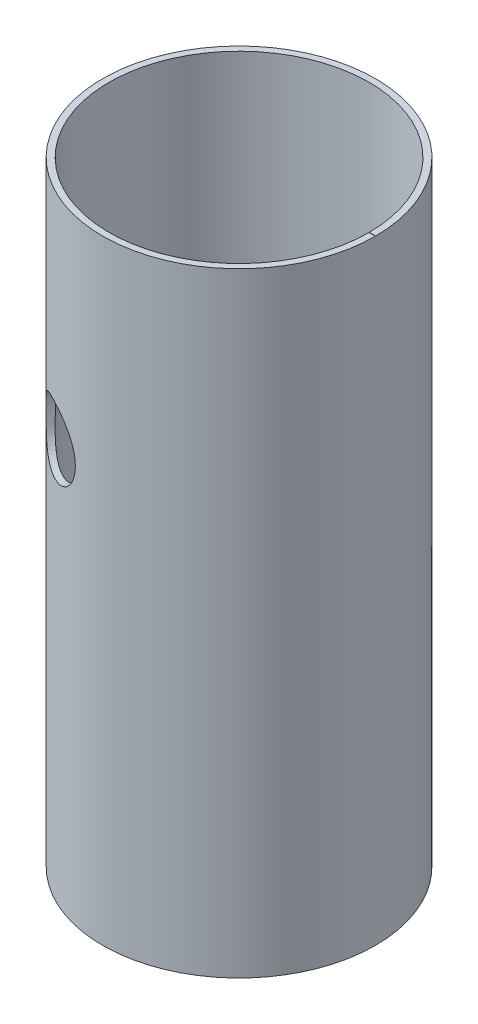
ISO-10303-21;
HEADER;
FILE_DESCRIPTION(('STEP AP214'),'2;1');
FILE_NAME('part.step','',(''),(''),'','','');
FILE_SCHEMA(('AUTOMOTIVE_DESIGN { 1 0 10303 214 1 1 1 1 }'));
ENDSEC;
DATA;
#1=APPLICATION_CONTEXT('core data for automotive mechanical design processes');
#2=APPLICATION_PROTOCOL_DEFINITION('international standard','automotive_design',2000,#1);
#3=PRODUCT_CONTEXT('',#1,'mechanical');
#4=PRODUCT('Part','Part','',(#3));
#5=PRODUCT_RELATED_PRODUCT_CATEGORY('part','',(#4));
#6=PRODUCT_DEFINITION_FORMATION('','',#4);
#7=PRODUCT_DEFINITION_CONTEXT('part definition',#1,'design');
#8=PRODUCT_DEFINITION('design','',#6,#7);
#9=PRODUCT_DEFINITION_SHAPE('','',#8);
#10=(LENGTH_UNIT() NAMED_UNIT(*) SI_UNIT(.MILLI.,.METRE.));
#11=(NAMED_UNIT(*) PLANE_ANGLE_UNIT() SI_UNIT($,.RADIAN.));
#12=(NAMED_UNIT(*) SI_UNIT($,.STERADIAN.) SOLID_ANGLE_UNIT());
#13=UNCERTAINTY_MEASURE_WITH_UNIT(LENGTH_MEASURE(1.E-05),#10,'distance_accuracy_value','');
#14=(GEOMETRIC_REPRESENTATION_CONTEXT(3) GLOBAL_UNCERTAINTY_ASSIGNED_CONTEXT((#13)) GLOBAL_UNIT_ASSIGNED_CONTEXT((#10,
#11,#12)) REPRESENTATION_CONTEXT('',''));
#15=CARTESIAN_POINT('',(0.,0.,0.));
#16=DIRECTION('',(0.,0.,1.));
#17=DIRECTION('',(1.,0.,0.));
#18=AXIS2_PLACEMENT_3D('',#15,#16,#17);
#19=CARTESIAN_POINT('',(100.573445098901,340.5,-330.875513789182));
#20=DIRECTION('',(0.,-1.,0.));
#21=DIRECTION('',(0.,0.,-1.));
#22=AXIS2_PLACEMENT_3D('',#19,#20,#21);
#23=CYLINDRICAL_SURFACE('',#22,214.617906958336);
#24=CARTESIAN_POINT('',(52.,0.,-121.826556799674));
#25=CARTESIAN_POINT('',(51.9999994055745,-1.4245583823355,-121.826556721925));
#26=CARTESIAN_POINT('',(51.9414198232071,-2.84912739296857,-121.840142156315));
#27=CARTESIAN_POINT('',(51.7075798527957,-5.68813599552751,-121.894683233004));
#28=CARTESIAN_POINT('',(51.532318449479,-7.1025754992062,-121.93563911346));
#29=CARTESIAN_POINT('',(51.0665503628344,-9.91130467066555,-122.045509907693));
#30=CARTESIAN_POINT('',(50.7760394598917,-11.3055935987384,-122.11442584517));
#31=CARTESIAN_POINT('',(50.082186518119,-14.0640388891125,-122.281156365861));
#32=CARTESIAN_POINT('',(49.6788448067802,-15.4281953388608,-122.378970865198));
#33=CARTESIAN_POINT('',(48.762734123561,-18.1166334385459,-122.604731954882));
#34=CARTESIAN_POINT('',(48.2499691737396,-19.4409165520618,-122.732677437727));
#35=CARTESIAN_POINT('',(47.1193661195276,-22.0402826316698,-123.020161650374));
#36=CARTESIAN_POINT('',(46.5015281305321,-23.3153656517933,-123.17970034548));
#37=CARTESIAN_POINT('',(45.1661527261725,-25.8073000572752,-123.531947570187));
#38=CARTESIAN_POINT('',(44.4486220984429,-27.0241553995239,-123.724653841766));
#39=CARTESIAN_POINT('',(42.9200971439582,-29.3913291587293,-124.144854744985));
#40=CARTESIAN_POINT('',(42.1091028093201,-30.541647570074,-124.37234937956));
#41=CARTESIAN_POINT('',(40.3996790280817,-32.7694961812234,-124.863971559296));
#42=CARTESIAN_POINT('',(39.5011359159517,-33.8469285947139,-125.128146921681));
#43=CARTESIAN_POINT('',(37.6255042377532,-35.9204088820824,-125.694223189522));
#44=CARTESIAN_POINT('',(36.6484159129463,-36.9164570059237,-125.996123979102));
#45=CARTESIAN_POINT('',(34.6243923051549,-38.8211611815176,-126.638652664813));
#46=CARTESIAN_POINT('',(33.5774592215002,-39.72981998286,-126.979279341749));
#47=CARTESIAN_POINT('',(31.422904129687,-41.454863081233,-127.699878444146));
#48=CARTESIAN_POINT('',(30.3152813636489,-42.271246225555,-128.079851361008));
#49=CARTESIAN_POINT('',(28.0294574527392,-43.8210995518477,-128.886134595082));
#50=CARTESIAN_POINT('',(26.8503726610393,-44.5529110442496,-129.313126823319));
#51=CARTESIAN_POINT('',(24.4494195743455,-45.9143831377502,-130.207579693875));
#52=CARTESIAN_POINT('',(23.227551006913,-46.5440430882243,-130.675040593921));
#53=CARTESIAN_POINT('',(20.7509043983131,-47.6997655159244,-131.649564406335));
#54=CARTESIAN_POINT('',(19.496122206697,-48.2258148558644,-132.1566323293));
#55=CARTESIAN_POINT('',(16.9634849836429,-49.1738619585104,-133.208872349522));
#56=CARTESIAN_POINT('',(15.6856292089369,-49.5958563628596,-133.754045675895));
#57=CARTESIAN_POINT('',(13.0433060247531,-50.3574026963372,-134.912462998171));
#58=CARTESIAN_POINT('',(11.6780288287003,-50.6909393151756,-135.527813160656));
#59=CARTESIAN_POINT('',(8.94201370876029,-51.244402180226,-136.796146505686));
#60=CARTESIAN_POINT('',(7.57127561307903,-51.4643248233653,-137.449130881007));
#61=CARTESIAN_POINT('',(4.83310072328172,-51.7932727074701,-138.789708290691));
#62=CARTESIAN_POINT('',(3.46566478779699,-51.9022716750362,-139.477309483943));
#63=CARTESIAN_POINT('',(0.742477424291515,-52.0125566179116,-140.883480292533));
#64=CARTESIAN_POINT('',(-0.613273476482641,-52.0138377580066,-141.602051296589));
#65=CARTESIAN_POINT('',(-3.45105570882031,-51.906815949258,-143.145307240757));
#66=CARTESIAN_POINT('',(-4.93096309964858,-51.7866968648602,-143.973086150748));
#67=CARTESIAN_POINT('',(-7.85941050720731,-51.4237984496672,-145.656682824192));
#68=CARTESIAN_POINT('',(-9.30794848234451,-51.1810111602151,-146.51250240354));
#69=CARTESIAN_POINT('',(-12.1673675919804,-50.5775796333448,-148.247057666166));
#70=CARTESIAN_POINT('',(-13.5782259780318,-50.2168658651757,-149.125806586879));
#71=CARTESIAN_POINT('',(-16.3552899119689,-49.3822537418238,-150.89986955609));
#72=CARTESIAN_POINT('',(-17.7214936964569,-48.9083509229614,-151.795184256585));
#73=CARTESIAN_POINT('',(-20.5793987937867,-47.782275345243,-153.714088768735));
#74=CARTESIAN_POINT('',(-22.0641452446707,-47.1148936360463,-154.73914115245));
#75=CARTESIAN_POINT('',(-24.9627860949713,-45.6453765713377,-156.793185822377));
#76=CARTESIAN_POINT('',(-26.3766706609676,-44.8432225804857,-157.822178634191));
#77=CARTESIAN_POINT('',(-29.1271737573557,-43.1074639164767,-159.873934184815));
#78=CARTESIAN_POINT('',(-30.4637634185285,-42.1738105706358,-160.896694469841));
#79=CARTESIAN_POINT('',(-33.0518811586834,-40.1776490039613,-162.923679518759));
#80=CARTESIAN_POINT('',(-34.3034235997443,-39.115162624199,-163.927907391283));
#81=CARTESIAN_POINT('',(-36.5381560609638,-37.0263385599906,-165.760314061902));
#82=CARTESIAN_POINT('',(-37.5338981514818,-36.0172279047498,-166.592850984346));
#83=CARTESIAN_POINT('',(-39.4516846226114,-33.9057300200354,-168.224373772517));
#84=CARTESIAN_POINT('',(-40.3737274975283,-32.8033408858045,-169.023358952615));
#85=CARTESIAN_POINT('',(-42.1356855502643,-30.5069802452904,-170.574777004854));
#86=CARTESIAN_POINT('',(-42.9757090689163,-29.3131333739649,-171.327270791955));
#87=CARTESIAN_POINT('',(-44.5661735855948,-26.8332715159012,-172.772727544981));
#88=CARTESIAN_POINT('',(-45.3166417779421,-25.5472846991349,-173.46570856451));
#89=CARTESIAN_POINT('',(-46.5381031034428,-23.2262128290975,-174.607960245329));
#90=CARTESIAN_POINT('',(-47.0314548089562,-22.2111923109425,-175.074200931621));
#91=CARTESIAN_POINT('',(-47.9578198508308,-20.133083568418,-175.957088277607));
#92=CARTESIAN_POINT('',(-48.3908408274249,-19.0700014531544,-176.373741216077));
#93=CARTESIAN_POINT('',(-49.1908633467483,-16.8995830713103,-177.149106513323));
#94=CARTESIAN_POINT('',(-49.5579082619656,-15.7922764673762,-177.507856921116));
#95=CARTESIAN_POINT('',(-50.2207435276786,-13.5372418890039,-178.159518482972));
#96=CARTESIAN_POINT('',(-50.5165330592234,-12.3895134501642,-178.452428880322));
#97=CARTESIAN_POINT('',(-50.903912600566,-10.6374301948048,-178.837724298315));
#98=CARTESIAN_POINT('',(-51.0241212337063,-10.0452226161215,-178.957614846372));
#99=CARTESIAN_POINT('',(-51.2443474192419,-8.85346303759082,-179.177695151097));
#100=CARTESIAN_POINT('',(-51.3443675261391,-8.25391197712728,-179.277887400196));
#101=CARTESIAN_POINT('',(-51.5236726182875,-7.04858183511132,-179.457784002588));
#102=CARTESIAN_POINT('',(-51.602954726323,-6.44280190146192,-179.537485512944));
#103=CARTESIAN_POINT('',(-51.7402943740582,-5.22651107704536,-179.675711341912));
#104=CARTESIAN_POINT('',(-51.7983547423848,-4.6160008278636,-179.734238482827));
#105=CARTESIAN_POINT('',(-51.8928790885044,-3.39199684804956,-179.829592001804));
#106=CARTESIAN_POINT('',(-51.9293563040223,-2.77850517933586,-179.866431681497));
#107=CARTESIAN_POINT('',(-51.9805375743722,-1.54976863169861,-179.918136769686));
#108=CARTESIAN_POINT('',(-51.99524441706,-0.934523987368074,-179.933004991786));
#109=CARTESIAN_POINT('',(-52.0027968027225,0.296227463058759,-179.940638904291));
#110=CARTESIAN_POINT('',(-51.9956430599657,0.911734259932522,-179.933405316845));
#111=CARTESIAN_POINT('',(-51.9595320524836,2.14138993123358,-179.896914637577));
#112=CARTESIAN_POINT('',(-51.9305755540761,2.75553885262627,-179.867658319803));
#113=CARTESIAN_POINT('',(-51.8227305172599,4.41671327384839,-179.758798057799));
#114=CARTESIAN_POINT('',(-51.7229804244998,5.4611497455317,-179.658188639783));
#115=CARTESIAN_POINT('',(-51.4619116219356,7.53415914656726,-179.395712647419));
#116=CARTESIAN_POINT('',(-51.3006014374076,8.56273425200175,-179.233854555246));
#117=CARTESIAN_POINT('',(-50.9190067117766,10.5984689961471,-178.852635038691));
#118=CARTESIAN_POINT('',(-50.6986974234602,11.6056194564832,-178.633249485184));
#119=CARTESIAN_POINT('',(-50.2023989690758,13.592966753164,-178.14171715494));
#120=CARTESIAN_POINT('',(-49.9264008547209,14.573159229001,-177.869561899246));
#121=CARTESIAN_POINT('',(-49.2314696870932,16.7925658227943,-177.188702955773));
#122=CARTESIAN_POINT('',(-48.7945061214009,18.0211224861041,-176.763540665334));
#123=CARTESIAN_POINT('',(-47.8403163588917,20.4198853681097,-175.844420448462));
#124=CARTESIAN_POINT('',(-47.3230693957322,21.590076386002,-175.35044472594));
#125=CARTESIAN_POINT('',(-46.2148937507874,23.8703399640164,-174.304089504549));
#126=CARTESIAN_POINT('',(-45.6238452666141,24.9803104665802,-173.751615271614));
#127=CARTESIAN_POINT('',(-44.3754240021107,27.1362083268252,-172.599193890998));
#128=CARTESIAN_POINT('',(-43.7180478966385,28.1821324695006,-171.999244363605));
#129=CARTESIAN_POINT('',(-42.1152746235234,30.5443923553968,-170.556178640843));
#130=CARTESIAN_POINT('',(-41.1464898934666,31.835858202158,-169.698226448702));
#131=CARTESIAN_POINT('',(-39.1126753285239,34.3038908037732,-167.932428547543));
#132=CARTESIAN_POINT('',(-38.0476150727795,35.4804209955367,-167.024567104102));
#133=CARTESIAN_POINT('',(-35.8297851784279,37.7188258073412,-165.173697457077));
#134=CARTESIAN_POINT('',(-34.6769696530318,38.7806397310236,-164.230670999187));
#135=CARTESIAN_POINT('',(-32.2916472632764,40.7882257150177,-162.32271518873));
#136=CARTESIAN_POINT('',(-31.0591470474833,41.7340074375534,-161.357787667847));
#137=CARTESIAN_POINT('',(-28.4982907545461,43.5239091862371,-159.399635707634));
#138=CARTESIAN_POINT('',(-27.1686259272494,44.3659380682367,-158.406212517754));
#139=CARTESIAN_POINT('',(-24.4394259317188,45.9258610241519,-156.41784405));
#140=CARTESIAN_POINT('',(-23.0398899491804,46.6437536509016,-155.422898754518));
#141=CARTESIAN_POINT('',(-20.1771427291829,47.9516378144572,-153.440530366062));
#142=CARTESIAN_POINT('',(-18.7139300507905,48.5416264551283,-152.453107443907));
#143=CARTESIAN_POINT('',(-15.7301406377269,49.5889294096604,-150.493958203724));
#144=CARTESIAN_POINT('',(-14.209560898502,50.0462367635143,-149.522232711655));
#145=CARTESIAN_POINT('',(-11.8206341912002,50.6461231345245,-148.038412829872));
#146=CARTESIAN_POINT('',(-10.9694608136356,50.8373481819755,-147.517859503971));
#147=CARTESIAN_POINT('',(-9.25374873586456,51.1774634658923,-146.485071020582));
#148=CARTESIAN_POINT('',(-8.38921134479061,51.3263578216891,-145.972835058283));
#149=CARTESIAN_POINT('',(-6.64806571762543,51.5807862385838,-144.957764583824));
#150=CARTESIAN_POINT('',(-5.77145490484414,51.6863108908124,-144.454932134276));
#151=CARTESIAN_POINT('',(-4.00809691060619,51.8528622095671,-143.460008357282));
#152=CARTESIAN_POINT('',(-3.12135102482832,51.9138945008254,-142.967915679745));
#153=CARTESIAN_POINT('',(-1.33958467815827,51.9903886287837,-141.99563084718));
#154=CARTESIAN_POINT('',(-0.444565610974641,52.0058580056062,-141.515436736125));
#155=CARTESIAN_POINT('',(1.35178567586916,51.9901849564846,-140.568027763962));
#156=CARTESIAN_POINT('',(2.25311708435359,51.9590484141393,-140.100811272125));
#157=CARTESIAN_POINT('',(4.05996655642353,51.8491640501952,-139.180385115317));
#158=CARTESIAN_POINT('',(4.96548436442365,51.7704190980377,-138.727174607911));
#159=CARTESIAN_POINT('',(6.77837339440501,51.5643853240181,-137.835749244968));
#160=CARTESIAN_POINT('',(7.68574455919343,51.4370979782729,-137.397533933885));
#161=CARTESIAN_POINT('',(9.40957370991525,51.1482735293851,-136.579831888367));
#162=CARTESIAN_POINT('',(10.226100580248,50.9914003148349,-136.198838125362));
#163=CARTESIAN_POINT('',(11.8566574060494,50.6370986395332,-135.450381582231));
#164=CARTESIAN_POINT('',(12.6706871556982,50.4396669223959,-135.082919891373));
#165=CARTESIAN_POINT('',(14.294004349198,50.0038764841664,-134.362173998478));
#166=CARTESIAN_POINT('',(15.1032920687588,49.7655201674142,-134.00888896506));
#167=CARTESIAN_POINT('',(16.7149311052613,49.2476136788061,-133.317004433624));
#168=CARTESIAN_POINT('',(17.5172825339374,48.9680641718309,-132.978404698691));
#169=CARTESIAN_POINT('',(19.112087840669,48.3678964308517,-132.316610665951));
#170=CARTESIAN_POINT('',(19.9045491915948,48.0473115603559,-131.993404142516));
#171=CARTESIAN_POINT('',(21.4777309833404,47.3649878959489,-131.362526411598));
#172=CARTESIAN_POINT('',(22.2584529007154,47.0032543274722,-131.054853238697));
#173=CARTESIAN_POINT('',(23.8057482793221,46.2388465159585,-130.455317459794));
#174=CARTESIAN_POINT('',(24.5723224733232,45.8361744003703,-130.163454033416));
#175=CARTESIAN_POINT('',(26.0888387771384,44.990290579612,-129.595746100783));
#176=CARTESIAN_POINT('',(26.8387815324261,44.5470804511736,-129.319900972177));
#177=CARTESIAN_POINT('',(28.2192573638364,43.6834489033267,-128.820617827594));
#178=CARTESIAN_POINT('',(28.8522111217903,43.2680656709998,-128.595140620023));
#179=CARTESIAN_POINT('',(30.1022355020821,42.407912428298,-128.156266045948));
#180=CARTESIAN_POINT('',(30.7193048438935,41.9631400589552,-127.94286965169));
#181=CARTESIAN_POINT('',(31.9357650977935,41.0449451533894,-127.528205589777));
#182=CARTESIAN_POINT('',(32.5351592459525,40.571527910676,-127.326935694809));
#183=CARTESIAN_POINT('',(33.714855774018,39.5966422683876,-126.936402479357));
#184=CARTESIAN_POINT('',(34.2951561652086,39.0951709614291,-126.747140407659));
#185=CARTESIAN_POINT('',(35.4347975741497,38.065269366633,-126.380622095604));
#186=CARTESIAN_POINT('',(35.9941473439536,37.536850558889,-126.203360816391));
#187=CARTESIAN_POINT('',(37.0906905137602,36.4537331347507,-125.860597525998));
#188=CARTESIAN_POINT('',(37.6278814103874,35.8990315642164,-125.695096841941));
#189=CARTESIAN_POINT('',(38.6785147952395,34.7644943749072,-125.375720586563));
#190=CARTESIAN_POINT('',(39.1919605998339,34.1846622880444,-125.221843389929));
#191=CARTESIAN_POINT('',(40.1937958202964,33.0009141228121,-124.925478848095));
#192=CARTESIAN_POINT('',(40.6821828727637,32.396995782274,-124.782992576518));
#193=CARTESIAN_POINT('',(42.0356419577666,30.6442209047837,-124.393052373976));
#194=CARTESIAN_POINT('',(42.868955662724,29.4675221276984,-124.159044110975));
#195=CARTESIAN_POINT('',(44.4374237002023,27.0443892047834,-123.727607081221));
#196=CARTESIAN_POINT('',(45.1725836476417,25.7979590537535,-123.530176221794));
#197=CARTESIAN_POINT('',(46.5380966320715,23.2443810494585,-123.170131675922));
#198=CARTESIAN_POINT('',(47.1684681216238,21.9372439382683,-123.007511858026));
#199=CARTESIAN_POINT('',(48.318817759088,19.2717142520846,-122.715353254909));
#200=CARTESIAN_POINT('',(48.8387971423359,17.9133222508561,-122.585814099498));
#201=CARTESIAN_POINT('',(49.7462198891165,15.2076293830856,-122.362566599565));
#202=CARTESIAN_POINT('',(50.1379359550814,13.8618559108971,-122.267687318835));
#203=CARTESIAN_POINT('',(50.811711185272,11.1415187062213,-122.105937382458));
#204=CARTESIAN_POINT('',(51.0937740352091,9.76695594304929,-122.0390657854));
#205=CARTESIAN_POINT('',(51.5459784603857,6.99852071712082,-121.932441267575));
#206=CARTESIAN_POINT('',(51.7161211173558,5.60464844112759,-121.892688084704));
#207=CARTESIAN_POINT('',(51.9431332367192,2.8071876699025,-121.839745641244));
#208=CARTESIAN_POINT('',(52.0000005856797,1.40359899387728,-121.82655687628));
#209=CARTESIAN_POINT('',(52.,0.,-121.826556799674));
#210=B_SPLINE_CURVE_WITH_KNOTS('',3,(#24,#25,#26,#27,#28,#29,#30,#31,#32,#33,#34,#35,#36,#37,
#38,#39,#40,#41,#42,#43,#44,#45,#46,#47,#48,#49,#50,#51,#52,#53,#54,#55,#56,#57,#58,#59,#60,#61,
#62,#63,#64,#65,#66,#67,#68,#69,#70,#71,#72,#73,#74,#75,#76,#77,#78,#79,#80,#81,#82,#83,#84,#85,
#86,#87,#88,#89,#90,#91,#92,#93,#94,#95,#96,#97,#98,#99,#100,#101,#102,#103,#104,#105,#106,#107,
#108,#109,#110,#111,#112,#113,#114,#115,#116,#117,#118,#119,#120,#121,#122,#123,#124,#125,#126,
#127,#128,#129,#130,#131,#132,#133,#134,#135,#136,#137,#138,#139,#140,#141,#142,#143,#144,#145,
#146,#147,#148,#149,#150,#151,#152,#153,#154,#155,#156,#157,#158,#159,#160,#161,#162,#163,#164,
#165,#166,#167,#168,#169,#170,#171,#172,#173,#174,#175,#176,#177,#178,#179,#180,#181,#182,#183,
#184,#185,#186,#187,#188,#189,#190,#191,#192,#193,#194,#195,#196,#197,#198,#199,#200,#201,#202,
#203,#204,#205,#206,#207,#208,#209),.UNSPECIFIED.,.T.,.F.,(4,2,2,2,2,2,2,2,2,2,2,2,2,2,2,2,2,2,
2,2,2,2,2,2,2,2,2,2,2,2,2,2,2,2,2,2,2,2,2,2,2,2,2,2,2,2,2,2,2,2,2,2,2,2,2,2,2,2,2,2,2,2,2,2,2,2,
2,2,2,2,2,2,2,2,2,2,2,2,2,2,2,2,2,2,2,2,2,2,2,2,2,2,4),(0.,4.27242707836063,8.54489133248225,
12.8175120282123,17.0901203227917,21.362571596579,25.635018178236,29.9071740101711,
34.1793302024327,38.4571088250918,42.734874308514,47.0125051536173,51.2901894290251,
55.6411054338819,59.9920491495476,64.3435441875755,68.6951796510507,73.2930234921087,
77.8910131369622,82.4900916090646,87.0893765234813,92.1839654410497,97.278884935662,
102.376813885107,107.474943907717,113.239822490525,119.005498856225,124.773314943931,
130.540154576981,135.468055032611,140.396056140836,145.317457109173,150.237359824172,
153.897562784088,157.557301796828,161.214626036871,164.871992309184,166.719610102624,
168.566993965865,170.414634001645,172.262027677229,174.10828710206,175.9543100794,
177.800272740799,179.646170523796,182.804078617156,185.961549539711,189.120346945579,
192.279652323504,196.388155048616,200.497722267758,204.614049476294,208.730583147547,
214.207576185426,219.686305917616,225.167920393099,230.649078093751,236.227066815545,
241.805120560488,247.383300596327,252.96177319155,256.008603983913,259.055138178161,
262.102332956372,265.149142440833,268.195447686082,271.241368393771,274.28710553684,
277.33275007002,280.075564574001,282.818599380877,285.56147308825,288.304302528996,
291.044915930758,293.785181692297,296.525305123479,299.265322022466,301.634387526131,
304.003643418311,306.372462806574,308.741528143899,311.109592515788,313.477923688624,
315.845923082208,318.214145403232,322.590547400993,326.96669893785,331.342079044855,
335.717410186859,339.927081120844,344.136610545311,348.346099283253,352.555666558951),.UNSPECIFIED.);
#211=CARTESIAN_POINT('',(52.,0.,-121.826556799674));
#212=VERTEX_POINT('',#211);
#213=EDGE_CURVE('E98',#212,#212,#210,.T.);
#214=ORIENTED_EDGE('',*,*,#213,.T.);
#215=EDGE_LOOP('',(#214));
#216=FACE_BOUND('',#215,.T.);
#217=DIRECTION('',(0.,-1.,0.));
#218=VECTOR('',#217,1.);
#219=CARTESIAN_POINT('',(315.191191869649,340.5,-331.137731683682));
#220=LINE('',#219,#218);
#221=CARTESIAN_POINT('',(315.191191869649,340.5,-331.137731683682));
#222=VERTEX_POINT('',#221);
#223=CARTESIAN_POINT('',(315.191191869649,-626.,-331.137731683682));
#224=VERTEX_POINT('',#223);
#225=EDGE_CURVE('E55',#222,#224,#220,.T.);
#226=ORIENTED_EDGE('',*,*,#225,.T.);
#227=CARTESIAN_POINT('',(100.573445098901,-626.,-330.875513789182));
#228=DIRECTION('',(0.,1.,0.));
#229=DIRECTION('',(1.,0.,0.));
#230=AXIS2_PLACEMENT_3D('',#227,#228,#229);
#231=CIRCLE('',#230,214.617906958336);
#232=CARTESIAN_POINT('',(315.191191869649,-626.,-330.613295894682));
#233=VERTEX_POINT('',#232);
#234=EDGE_CURVE('E95',#224,#233,#231,.T.);
#235=ORIENTED_EDGE('',*,*,#234,.T.);
#236=DIRECTION('',(0.,-1.,0.));
#237=VECTOR('',#236,1.);
#238=CARTESIAN_POINT('',(315.191191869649,340.5,-330.613295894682));
#239=LINE('',#238,#237);
#240=CARTESIAN_POINT('',(315.191191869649,340.5,-330.613295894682));
#241=VERTEX_POINT('',#240);
#242=EDGE_CURVE('E11',#241,#233,#239,.T.);
#243=ORIENTED_EDGE('',*,*,#242,.F.);
#244=CARTESIAN_POINT('',(100.573445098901,340.5,-330.875513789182));
#245=DIRECTION('',(0.,1.,0.));
#246=DIRECTION('',(1.,0.,0.));
#247=AXIS2_PLACEMENT_3D('',#244,#245,#246);
#248=CIRCLE('',#247,214.617906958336);
#249=EDGE_CURVE('E108',#222,#241,#248,.T.);
#250=ORIENTED_EDGE('',*,*,#249,.F.);
#251=EDGE_LOOP('',(#226,#235,#243,#250));
#252=FACE_BOUND('',#251,.T.);
#253=ADVANCED_FACE('F35',(#216,#252),#23,.T.);
#254=CARTESIAN_POINT('',(305.191199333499,340.5,-330.625513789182));
#255=DIRECTION('',(0.00122178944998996,0.,-0.999999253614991));
#256=DIRECTION('',(-0.999999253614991,0.,-0.00122178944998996));
#257=AXIS2_PLACEMENT_3D('',#254,#255,#256);
#258=PLANE('',#257);
#259=ORIENTED_EDGE('',*,*,#242,.T.);
#260=DIRECTION('',(0.999999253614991,0.,0.00122178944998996));
#261=VECTOR('',#260,1.);
#262=CARTESIAN_POINT('',(305.191199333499,-626.,-330.625513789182));
#263=LINE('',#262,#261);
#264=CARTESIAN_POINT('',(305.191199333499,-626.,-330.625513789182));
#265=VERTEX_POINT('',#264);
#266=EDGE_CURVE('E85',#265,#233,#263,.T.);
#267=ORIENTED_EDGE('',*,*,#266,.F.);
#268=DIRECTION('',(0.,-1.,0.));
#269=VECTOR('',#268,1.);
#270=CARTESIAN_POINT('',(305.191199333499,340.5,-330.625513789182));
#271=LINE('',#270,#269);
#272=CARTESIAN_POINT('',(305.191199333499,340.5,-330.625513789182));
#273=VERTEX_POINT('',#272);
#274=EDGE_CURVE('E48',#273,#265,#271,.T.);
#275=ORIENTED_EDGE('',*,*,#274,.F.);
#276=DIRECTION('',(0.999999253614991,0.,0.00122178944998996));
#277=VECTOR('',#276,1.);
#278=CARTESIAN_POINT('',(305.191199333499,340.5,-330.625513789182));
#279=LINE('',#278,#277);
#280=EDGE_CURVE('E87',#273,#241,#279,.T.);
#281=ORIENTED_EDGE('',*,*,#280,.T.);
#282=EDGE_LOOP('',(#259,#267,#275,#281));
#283=FACE_BOUND('',#282,.T.);
#284=ADVANCED_FACE('F84',(#283),#258,.T.);
#285=CARTESIAN_POINT('',(100.573445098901,340.5,-330.875513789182));
#286=DIRECTION('',(0.,-1.,0.));
#287=DIRECTION('',(0.,0.,-1.));
#288=AXIS2_PLACEMENT_3D('',#285,#286,#287);
#289=CYLINDRICAL_SURFACE('',#288,204.617906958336);
#290=CARTESIAN_POINT('',(52.,0.,-132.106531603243));
#291=CARTESIAN_POINT('',(51.9999894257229,-1.41917207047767,-132.106530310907));
#292=CARTESIAN_POINT('',(51.941841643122,-2.83871803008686,-132.120715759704));
#293=CARTESIAN_POINT('',(51.7096657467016,-5.66804496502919,-132.177670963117));
#294=CARTESIAN_POINT('',(51.5355953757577,-7.07782218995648,-132.220451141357));
#295=CARTESIAN_POINT('',(51.0726500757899,-9.87941723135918,-132.335300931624));
#296=CARTESIAN_POINT('',(50.7836036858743,-11.2712050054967,-132.407414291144));
#297=CARTESIAN_POINT('',(50.0931782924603,-14.0245428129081,-132.581900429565));
#298=CARTESIAN_POINT('',(49.6918097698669,-15.3860956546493,-132.68427038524));
#299=CARTESIAN_POINT('',(48.7804442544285,-18.0685779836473,-132.920483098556));
#300=CARTESIAN_POINT('',(48.2705157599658,-19.3895324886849,-133.054306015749));
#301=CARTESIAN_POINT('',(47.1462785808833,-21.9823825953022,-133.354972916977));
#302=CARTESIAN_POINT('',(46.5319677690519,-23.2542771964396,-133.521817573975));
#303=CARTESIAN_POINT('',(45.2046459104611,-25.7395357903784,-133.890088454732));
#304=CARTESIAN_POINT('',(44.491676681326,-26.952924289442,-134.091500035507));
#305=CARTESIAN_POINT('',(42.9731838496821,-29.3133904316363,-134.530607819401));
#306=CARTESIAN_POINT('',(42.1676607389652,-30.4604684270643,-134.768303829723));
#307=CARTESIAN_POINT('',(40.4699644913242,-32.6824084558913,-135.281938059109));
#308=CARTESIAN_POINT('',(39.5776576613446,-33.7571546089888,-135.55793557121));
#309=CARTESIAN_POINT('',(37.715543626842,-35.8256093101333,-136.149228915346));
#310=CARTESIAN_POINT('',(36.7457365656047,-36.8193180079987,-136.464524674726));
#311=CARTESIAN_POINT('',(34.7373610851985,-38.7198556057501,-137.135433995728));
#312=CARTESIAN_POINT('',(33.6987908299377,-39.6266821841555,-137.491048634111));
#313=CARTESIAN_POINT('',(31.5621897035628,-41.3486499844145,-138.243177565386));
#314=CARTESIAN_POINT('',(30.4641580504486,-42.1637900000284,-138.639692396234));
#315=CARTESIAN_POINT('',(28.1973130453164,-43.7130546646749,-139.481491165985));
#316=CARTESIAN_POINT('',(27.027562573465,-44.4453887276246,-139.927545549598));
#317=CARTESIAN_POINT('',(24.6465649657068,-45.8086114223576,-140.861745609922));
#318=CARTESIAN_POINT('',(23.4353175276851,-46.4394993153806,-141.349891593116));
#319=CARTESIAN_POINT('',(20.9812498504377,-47.5986234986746,-142.367331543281));
#320=CARTESIAN_POINT('',(19.738425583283,-48.1268466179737,-142.896630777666));
#321=CARTESIAN_POINT('',(17.2310407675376,-49.0804502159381,-143.994789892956));
#322=CARTESIAN_POINT('',(15.966479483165,-49.505827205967,-144.563651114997));
#323=CARTESIAN_POINT('',(13.3464973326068,-50.2777186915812,-145.775119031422));
#324=CARTESIAN_POINT('',(11.9902746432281,-50.6177678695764,-146.420109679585));
#325=CARTESIAN_POINT('',(9.27367610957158,-51.1852006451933,-147.749526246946));
#326=CARTESIAN_POINT('',(7.91330012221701,-51.4125803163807,-148.433953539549));
#327=CARTESIAN_POINT('',(5.19706090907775,-51.7577566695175,-149.83913097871));
#328=CARTESIAN_POINT('',(3.84119892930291,-51.8755252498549,-150.559890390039));
#329=CARTESIAN_POINT('',(1.14224683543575,-52.0050083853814,-152.033992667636));
#330=CARTESIAN_POINT('',(-0.200842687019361,-52.0167180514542,-152.787337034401));
#331=CARTESIAN_POINT('',(-3.02460710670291,-51.9333718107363,-154.413368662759));
#332=CARTESIAN_POINT('',(-4.50283746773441,-51.8255677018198,-155.289655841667));
#333=CARTESIAN_POINT('',(-7.42657407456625,-51.4879800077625,-157.072704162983));
#334=CARTESIAN_POINT('',(-8.87207800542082,-51.2581878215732,-157.979467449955));
#335=CARTESIAN_POINT('',(-11.7243160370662,-50.6819345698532,-159.818267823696));
#336=CARTESIAN_POINT('',(-13.1310275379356,-50.335406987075,-160.750319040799));
#337=CARTESIAN_POINT('',(-15.8990929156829,-49.5307639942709,-162.633311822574));
#338=CARTESIAN_POINT('',(-17.2604449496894,-49.0726440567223,-163.584254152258));
#339=CARTESIAN_POINT('',(-20.129880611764,-47.9737780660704,-165.640073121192));
#340=CARTESIAN_POINT('',(-21.6300315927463,-47.3160695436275,-166.746987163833));
#341=CARTESIAN_POINT('',(-24.5578083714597,-45.8648482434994,-168.968026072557));
#342=CARTESIAN_POINT('',(-25.9854233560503,-45.0713152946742,-170.082151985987));
#343=CARTESIAN_POINT('',(-28.7626078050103,-43.3518326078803,-172.307417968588));
#344=CARTESIAN_POINT('',(-30.1121345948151,-42.4258114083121,-173.418556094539));
#345=CARTESIAN_POINT('',(-32.7258296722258,-40.4439071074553,-175.625023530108));
#346=CARTESIAN_POINT('',(-33.9900123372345,-39.3880459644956,-176.720355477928));
#347=CARTESIAN_POINT('',(-36.2515374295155,-37.3073309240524,-178.72637903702));
#348=CARTESIAN_POINT('',(-37.2611759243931,-36.2996652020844,-179.641061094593));
#349=CARTESIAN_POINT('',(-39.2071925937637,-34.1885509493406,-181.437853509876));
#350=CARTESIAN_POINT('',(-40.1435670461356,-33.0850975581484,-182.319962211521));
#351=CARTESIAN_POINT('',(-41.9348138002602,-30.7830431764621,-184.037434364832));
#352=CARTESIAN_POINT('',(-42.789796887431,-29.5845757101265,-184.872860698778));
#353=CARTESIAN_POINT('',(-44.4108353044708,-27.0903724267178,-186.482475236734));
#354=CARTESIAN_POINT('',(-45.1769239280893,-25.794673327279,-187.25668633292));
#355=CARTESIAN_POINT('',(-46.4006633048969,-23.4977418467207,-188.511090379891));
#356=CARTESIAN_POINT('',(-46.8831794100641,-22.5205973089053,-189.011262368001));
#357=CARTESIAN_POINT('',(-47.7933836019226,-20.5183201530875,-189.963465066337));
#358=CARTESIAN_POINT('',(-48.2210762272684,-19.4931915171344,-190.415499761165));
#359=CARTESIAN_POINT('',(-49.015855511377,-17.3982588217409,-191.262240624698));
#360=CARTESIAN_POINT('',(-49.3830156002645,-16.328510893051,-191.657016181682));
#361=CARTESIAN_POINT('',(-50.0516286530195,-14.1469140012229,-192.380683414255));
#362=CARTESIAN_POINT('',(-50.353092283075,-13.0350719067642,-192.709585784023));
#363=CARTESIAN_POINT('',(-50.8430488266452,-10.9518797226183,-193.246868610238));
#364=CARTESIAN_POINT('',(-51.0418342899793,-9.98573147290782,-193.466051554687));
#365=CARTESIAN_POINT('',(-51.3854144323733,-8.03255699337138,-193.846105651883));
#366=CARTESIAN_POINT('',(-51.5302147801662,-7.04553296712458,-194.006982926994));
#367=CARTESIAN_POINT('',(-51.7631672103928,-5.05724511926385,-194.266308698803));
#368=CARTESIAN_POINT('',(-51.8513529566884,-4.05599012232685,-194.364794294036));
#369=CARTESIAN_POINT('',(-51.9694974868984,-2.04573202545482,-194.496826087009));
#370=CARTESIAN_POINT('',(-51.9994554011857,-1.03672881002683,-194.53037131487));
#371=CARTESIAN_POINT('',(-52.0005305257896,0.982610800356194,-194.53157437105));
#372=CARTESIAN_POINT('',(-51.9715741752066,1.9929472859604,-194.4991498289));
#373=CARTESIAN_POINT('',(-51.8552667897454,4.00597722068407,-194.369165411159));
#374=CARTESIAN_POINT('',(-51.767916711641,5.00867079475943,-194.271606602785));
#375=CARTESIAN_POINT('',(-51.5364595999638,6.99990261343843,-194.013924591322));
#376=CARTESIAN_POINT('',(-51.3923190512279,7.98843214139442,-193.853764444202));
#377=CARTESIAN_POINT('',(-51.0498814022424,9.94465366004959,-193.474932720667));
#378=CARTESIAN_POINT('',(-50.8515777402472,10.9123431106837,-193.256254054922));
#379=CARTESIAN_POINT('',(-50.3521989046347,13.0427569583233,-192.708567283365));
#380=CARTESIAN_POINT('',(-50.0379635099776,14.1988593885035,-192.365740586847));
#381=CARTESIAN_POINT('',(-49.3386061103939,16.4654098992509,-191.60911542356));
#382=CARTESIAN_POINT('',(-48.9534685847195,17.5758479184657,-191.195301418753));
#383=CARTESIAN_POINT('',(-48.1180559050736,19.7486632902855,-190.306321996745));
#384=CARTESIAN_POINT('',(-47.6676768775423,20.8109603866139,-189.831058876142));
#385=CARTESIAN_POINT('',(-46.7081710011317,22.8834252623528,-188.829413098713));
#386=CARTESIAN_POINT('',(-46.1990401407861,23.8935894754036,-188.303026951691));
#387=CARTESIAN_POINT('',(-44.9177423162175,26.2454531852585,-186.993841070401));
#388=CARTESIAN_POINT('',(-44.1205146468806,27.5625178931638,-186.191200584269));
#389=CARTESIAN_POINT('',(-42.4339085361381,30.0945010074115,-184.523908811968));
#390=CARTESIAN_POINT('',(-41.5444943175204,31.3093794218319,-183.659233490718));
#391=CARTESIAN_POINT('',(-39.6820188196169,33.638704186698,-181.883738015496));
#392=CARTESIAN_POINT('',(-38.7088948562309,34.7530739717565,-180.972883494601));
#393=CARTESIAN_POINT('',(-36.68683861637,36.8812988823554,-179.119183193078));
#394=CARTESIAN_POINT('',(-35.637913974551,37.895164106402,-178.17634063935));
#395=CARTESIAN_POINT('',(-33.4367628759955,39.8524466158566,-176.240572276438));
#396=CARTESIAN_POINT('',(-32.2823608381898,40.7927699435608,-175.24699612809));
#397=CARTESIAN_POINT('',(-29.9042173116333,42.5668695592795,-173.247849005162));
#398=CARTESIAN_POINT('',(-28.6804748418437,43.4006443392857,-172.242277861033));
#399=CARTESIAN_POINT('',(-26.1681251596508,44.9601562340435,-170.227900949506));
#400=CARTESIAN_POINT('',(-24.8795060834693,45.6858734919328,-169.219094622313));
#401=CARTESIAN_POINT('',(-22.241871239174,47.0264547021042,-167.206221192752));
#402=CARTESIAN_POINT('',(-20.8928503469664,47.6413092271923,-166.202154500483));
#403=CARTESIAN_POINT('',(-18.6987691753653,48.5297226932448,-164.611724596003));
#404=CARTESIAN_POINT('',(-17.8715052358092,48.8404875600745,-164.021305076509));
#405=CARTESIAN_POINT('',(-16.1985599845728,49.4205456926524,-162.846257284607));
#406=CARTESIAN_POINT('',(-15.3528800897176,49.6898421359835,-162.261628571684));
#407=CARTESIAN_POINT('',(-13.644025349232,50.1859781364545,-161.099409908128));
#408=CARTESIAN_POINT('',(-12.7808455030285,50.4128053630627,-160.521822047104));
#409=CARTESIAN_POINT('',(-11.0386307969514,50.8227247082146,-159.375310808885));
#410=CARTESIAN_POINT('',(-10.159597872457,51.0058221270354,-158.806386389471));
#411=CARTESIAN_POINT('',(-8.38749277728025,51.326994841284,-157.678792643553));
#412=CARTESIAN_POINT('',(-7.4944281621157,51.4650935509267,-157.120118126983));
#413=CARTESIAN_POINT('',(-5.69554453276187,51.695095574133,-156.014127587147));
#414=CARTESIAN_POINT('',(-4.78972705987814,51.7870044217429,-155.46681021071));
#415=CARTESIAN_POINT('',(-2.96719541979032,51.9233140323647,-154.384873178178));
#416=CARTESIAN_POINT('',(-2.05048335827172,51.9677238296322,-153.850251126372));
#417=CARTESIAN_POINT('',(-0.208140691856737,52.0077473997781,-152.794949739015));
#418=CARTESIAN_POINT('',(0.717489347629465,52.0033642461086,-152.274269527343));
#419=CARTESIAN_POINT('',(3.09631643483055,51.9279859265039,-150.960431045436));
#420=CARTESIAN_POINT('',(4.55454078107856,51.8210465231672,-150.178051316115));
#421=CARTESIAN_POINT('',(7.47758042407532,51.4805897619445,-148.654864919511));
#422=CARTESIAN_POINT('',(8.94239479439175,51.2470896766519,-147.914052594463));
#423=CARTESIAN_POINT('',(11.8673816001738,50.6496875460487,-146.478190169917));
#424=CARTESIAN_POINT('',(13.3275559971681,50.2858510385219,-145.783117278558));
#425=CARTESIAN_POINT('',(15.5049566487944,49.6404095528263,-144.777471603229));
#426=CARTESIAN_POINT('',(16.228727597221,49.4086030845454,-144.448367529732));
#427=CARTESIAN_POINT('',(17.6703767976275,48.911540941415,-143.802821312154));
#428=CARTESIAN_POINT('',(18.3882556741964,48.6462888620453,-143.486377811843));
#429=CARTESIAN_POINT('',(19.8203088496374,48.0806754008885,-142.864791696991));
#430=CARTESIAN_POINT('',(20.5344412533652,47.7801294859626,-142.559720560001));
#431=CARTESIAN_POINT('',(21.9531040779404,47.1451489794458,-141.963042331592));
#432=CARTESIAN_POINT('',(22.6576355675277,46.8107181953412,-141.671433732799));
#433=CARTESIAN_POINT('',(24.0553927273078,46.1080258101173,-141.101845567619));
#434=CARTESIAN_POINT('',(24.7486167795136,45.7397594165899,-140.823867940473));
#435=CARTESIAN_POINT('',(26.1216610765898,44.9697485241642,-140.281798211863));
#436=CARTESIAN_POINT('',(26.8014828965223,44.5680079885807,-140.017704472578));
#437=CARTESIAN_POINT('',(28.145796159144,43.7314627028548,-139.503516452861));
#438=CARTESIAN_POINT('',(28.8102893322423,43.2966617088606,-139.253420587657));
#439=CARTESIAN_POINT('',(30.1220114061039,42.3945509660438,-138.767282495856));
#440=CARTESIAN_POINT('',(30.7692423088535,41.9272450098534,-138.531238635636));
#441=CARTESIAN_POINT('',(32.0445808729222,40.9607735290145,-138.073175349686));
#442=CARTESIAN_POINT('',(32.6726888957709,40.4616086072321,-137.851155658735));
#443=CARTESIAN_POINT('',(33.9078872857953,39.4322389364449,-137.421077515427));
#444=CARTESIAN_POINT('',(34.514978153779,38.9020349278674,-137.213018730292));
#445=CARTESIAN_POINT('',(35.6495026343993,37.8635273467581,-136.829918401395));
#446=CARTESIAN_POINT('',(36.1790133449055,37.3579533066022,-136.653620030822));
#447=CARTESIAN_POINT('',(37.218034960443,36.3229349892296,-136.31221069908));
#448=CARTESIAN_POINT('',(37.72754419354,35.7934887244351,-136.147100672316));
#449=CARTESIAN_POINT('',(38.7251457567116,34.71173235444,-135.827955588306));
#450=CARTESIAN_POINT('',(39.213241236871,34.1594256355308,-135.673918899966));
#451=CARTESIAN_POINT('',(40.1669055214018,33.0327785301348,-135.376697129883));
#452=CARTESIAN_POINT('',(40.6324720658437,32.4584359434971,-135.233513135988));
#453=CARTESIAN_POINT('',(41.5398619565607,31.2887798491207,-134.957804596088));
#454=CARTESIAN_POINT('',(41.9816844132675,30.6934655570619,-134.825280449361));
#455=CARTESIAN_POINT('',(42.8404925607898,29.4829276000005,-134.570662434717));
#456=CARTESIAN_POINT('',(43.257475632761,28.8677018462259,-134.448569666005));
#457=CARTESIAN_POINT('',(44.0654532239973,27.6186336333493,-134.214608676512));
#458=CARTESIAN_POINT('',(44.45645137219,26.9847937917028,-134.102739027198));
#459=CARTESIAN_POINT('',(45.2115537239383,25.6996333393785,-133.888959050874));
#460=CARTESIAN_POINT('',(45.5756553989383,25.0483110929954,-133.787049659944));
#461=CARTESIAN_POINT('',(46.5933429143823,23.1318934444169,-133.505007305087));
#462=CARTESIAN_POINT('',(47.2104092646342,21.8452326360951,-133.337632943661));
#463=CARTESIAN_POINT('',(48.3378001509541,19.2222688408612,-133.036523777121));
#464=CARTESIAN_POINT('',(48.8481186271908,17.8859630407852,-132.90279088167));
#465=CARTESIAN_POINT('',(49.7568632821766,15.1754577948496,-132.66758543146));
#466=CARTESIAN_POINT('',(50.1554659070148,13.8013219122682,-132.566061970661));
#467=CARTESIAN_POINT('',(50.8382704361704,11.0233678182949,-132.393714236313));
#468=CARTESIAN_POINT('',(51.1225141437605,9.61956065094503,-132.322878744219));
#469=CARTESIAN_POINT('',(51.4567404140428,7.52832638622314,-132.240046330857));
#470=CARTESIAN_POINT('',(51.5516576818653,6.84823254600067,-132.216612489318));
#471=CARTESIAN_POINT('',(51.7144918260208,5.48474624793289,-132.176500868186));
#472=CARTESIAN_POINT('',(51.7824152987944,4.80135463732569,-132.159821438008));
#473=CARTESIAN_POINT('',(51.8911455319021,3.43228275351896,-132.133156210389));
#474=CARTESIAN_POINT('',(51.9319521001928,2.74660246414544,-132.123170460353));
#475=CARTESIAN_POINT('',(51.9863851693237,1.37397750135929,-132.109857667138));
#476=CARTESIAN_POINT('',(52.0000051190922,0.687032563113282,-132.106532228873));
#477=CARTESIAN_POINT('',(52.,0.,-132.106531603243));
#478=B_SPLINE_CURVE_WITH_KNOTS('',3,(#290,#291,#292,#293,#294,#295,#296,#297,#298,#299,#300,
#301,#302,#303,#304,#305,#306,#307,#308,#309,#310,#311,#312,#313,#314,#315,#316,#317,#318,#319,
#320,#321,#322,#323,#324,#325,#326,#327,#328,#329,#330,#331,#332,#333,#334,#335,#336,#337,#338,
#339,#340,#341,#342,#343,#344,#345,#346,#347,#348,#349,#350,#351,#352,#353,#354,#355,#356,#357,
#358,#359,#360,#361,#362,#363,#364,#365,#366,#367,#368,#369,#370,#371,#372,#373,#374,#375,#376,
#377,#378,#379,#380,#381,#382,#383,#384,#385,#386,#387,#388,#389,#390,#391,#392,#393,#394,#395,
#396,#397,#398,#399,#400,#401,#402,#403,#404,#405,#406,#407,#408,#409,#410,#411,#412,#413,#414,
#415,#416,#417,#418,#419,#420,#421,#422,#423,#424,#425,#426,#427,#428,#429,#430,#431,#432,#433,
#434,#435,#436,#437,#438,#439,#440,#441,#442,#443,#444,#445,#446,#447,#448,#449,#450,#451,#452,
#453,#454,#455,#456,#457,#458,#459,#460,#461,#462,#463,#464,#465,#466,#467,#468,#469,#470,#471,
#472,#473,#474,#475,#476,#477),.UNSPECIFIED.,.T.,.F.,(4,2,2,2,2,2,2,2,2,2,2,2,2,2,2,2,2,2,2,2,2,
2,2,2,2,2,2,2,2,2,2,2,2,2,2,2,2,2,2,2,2,2,2,2,2,2,2,2,2,2,2,2,2,2,2,2,2,2,2,2,2,2,2,2,2,2,2,2,2,
2,2,2,2,2,2,2,2,2,2,2,2,2,2,2,2,2,2,2,2,2,2,2,2,4),(0.,4.25690427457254,8.51536116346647,
12.7801925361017,17.0446260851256,21.3063768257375,25.5682144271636,29.8282510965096,
34.0882651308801,38.3549490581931,42.6216250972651,46.8884151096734,51.1552612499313,
55.5015356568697,59.8478417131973,64.194704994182,68.5417157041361,73.1562793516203,
77.7710038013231,82.3869110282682,87.0030310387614,92.1632976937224,97.3239282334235,
102.48750435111,107.651290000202,113.575875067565,119.501340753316,125.430014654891,
131.35768728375,136.437026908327,141.516624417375,146.589205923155,151.659881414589,
155.254366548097,158.848553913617,162.438348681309,166.02756019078,169.055799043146,
172.083719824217,175.109838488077,178.136002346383,181.165947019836,184.195842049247,
187.227527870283,190.259581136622,193.992497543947,197.726232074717,201.465977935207,
205.205979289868,210.406934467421,215.609915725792,220.816827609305,226.023215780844,
231.388483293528,236.75382673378,242.120154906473,247.486939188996,250.674472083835,
253.861760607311,257.04997309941,260.237798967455,263.423963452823,266.609746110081,
269.794922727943,272.979898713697,277.949290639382,282.918004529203,287.884223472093,
290.368124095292,292.851757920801,295.349009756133,297.845981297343,300.343307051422,
302.8403375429,305.337084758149,307.833541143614,310.329950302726,312.826299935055,
315.084706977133,317.34330240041,319.601564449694,321.860052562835,324.11862523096,
326.377435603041,328.635929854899,330.894636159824,335.199268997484,339.504146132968,
343.802185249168,348.098651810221,350.159446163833,352.219736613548,354.280041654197,
356.340843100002),.UNSPECIFIED.);
#479=CARTESIAN_POINT('',(52.,0.,-132.106531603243));
#480=VERTEX_POINT('',#479);
#481=EDGE_CURVE('E39',#480,#480,#478,.T.);
#482=ORIENTED_EDGE('',*,*,#481,.F.);
#483=EDGE_LOOP('',(#482));
#484=FACE_BOUND('',#483,.T.);
#485=ORIENTED_EDGE('',*,*,#274,.T.);
#486=CARTESIAN_POINT('',(100.573445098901,-626.,-330.875513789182));
#487=DIRECTION('',(0.,1.,0.));
#488=DIRECTION('',(0.,0.,1.));
#489=AXIS2_PLACEMENT_3D('',#486,#487,#488);
#490=CIRCLE('',#489,204.617906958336);
#491=CARTESIAN_POINT('',(305.191199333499,-626.,-331.125513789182));
#492=VERTEX_POINT('',#491);
#493=EDGE_CURVE('E96',#492,#265,#490,.T.);
#494=ORIENTED_EDGE('',*,*,#493,.F.);
#495=DIRECTION('',(0.,-1.,0.));
#496=VECTOR('',#495,1.);
#497=CARTESIAN_POINT('',(305.191199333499,340.5,-331.125513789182));
#498=LINE('',#497,#496);
#499=CARTESIAN_POINT('',(305.191199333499,340.5,-331.125513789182));
#500=VERTEX_POINT('',#499);
#501=EDGE_CURVE('E63',#500,#492,#498,.T.);
#502=ORIENTED_EDGE('',*,*,#501,.F.);
#503=CARTESIAN_POINT('',(100.573445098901,340.5,-330.875513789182));
#504=DIRECTION('',(0.,1.,0.));
#505=DIRECTION('',(0.,0.,1.));
#506=AXIS2_PLACEMENT_3D('',#503,#504,#505);
#507=CIRCLE('',#506,204.617906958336);
#508=EDGE_CURVE('E111',#500,#273,#507,.T.);
#509=ORIENTED_EDGE('',*,*,#508,.T.);
#510=EDGE_LOOP('',(#485,#494,#502,#509));
#511=FACE_BOUND('',#510,.T.);
#512=ADVANCED_FACE('F117',(#484,#511),#289,.F.);
#513=CARTESIAN_POINT('',(315.191191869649,340.5,-331.137731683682));
#514=DIRECTION('',(0.00122178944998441,0.,0.999999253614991));
#515=DIRECTION('',(0.999999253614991,0.,-0.00122178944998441));
#516=AXIS2_PLACEMENT_3D('',#513,#514,#515);
#517=PLANE('',#516);
#518=ORIENTED_EDGE('',*,*,#501,.T.);
#519=DIRECTION('',(-0.999999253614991,0.,0.00122178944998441));
#520=VECTOR('',#519,1.);
#521=CARTESIAN_POINT('',(315.191191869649,-626.,-331.137731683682));
#522=LINE('',#521,#520);
#523=EDGE_CURVE('E106',#224,#492,#522,.T.);
#524=ORIENTED_EDGE('',*,*,#523,.F.);
#525=ORIENTED_EDGE('',*,*,#225,.F.);
#526=DIRECTION('',(-0.999999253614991,0.,0.00122178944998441));
#527=VECTOR('',#526,1.);
#528=CARTESIAN_POINT('',(315.191191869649,340.5,-331.137731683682));
#529=LINE('',#528,#527);
#530=EDGE_CURVE('E113',#222,#500,#529,.T.);
#531=ORIENTED_EDGE('',*,*,#530,.T.);
#532=EDGE_LOOP('',(#518,#524,#525,#531));
#533=FACE_BOUND('',#532,.T.);
#534=ADVANCED_FACE('F121',(#533),#517,.T.);
#535=CARTESIAN_POINT('',(100.573445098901,340.5,-330.875513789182));
#536=DIRECTION('',(0.,1.,0.));
#537=DIRECTION('',(0.,0.,1.));
#538=AXIS2_PLACEMENT_3D('',#535,#536,#537);
#539=PLANE('',#538);
#540=ORIENTED_EDGE('',*,*,#249,.T.);
#541=ORIENTED_EDGE('',*,*,#280,.F.);
#542=ORIENTED_EDGE('',*,*,#508,.F.);
#543=ORIENTED_EDGE('',*,*,#530,.F.);
#544=EDGE_LOOP('',(#540,#541,#542,#543));
#545=FACE_BOUND('',#544,.T.);
#546=ADVANCED_FACE('F119',(#545),#539,.T.);
#547=CARTESIAN_POINT('',(100.573445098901,-626.,-330.875513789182));
#548=DIRECTION('',(0.,1.,0.));
#549=DIRECTION('',(0.,0.,1.));
#550=AXIS2_PLACEMENT_3D('',#547,#548,#549);
#551=PLANE('',#550);
#552=ORIENTED_EDGE('',*,*,#234,.F.);
#553=ORIENTED_EDGE('',*,*,#523,.T.);
#554=ORIENTED_EDGE('',*,*,#493,.T.);
#555=ORIENTED_EDGE('',*,*,#266,.T.);
#556=EDGE_LOOP('',(#552,#553,#554,#555));
#557=FACE_BOUND('',#556,.T.);
#558=ADVANCED_FACE('F93',(#557),#551,.F.);
#559=CARTESIAN_POINT('',(0.,0.,-330.875513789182));
#560=DIRECTION('',(0.,0.,1.));
#561=DIRECTION('',(1.,0.,0.));
#562=AXIS2_PLACEMENT_3D('',#559,#560,#561);
#563=CYLINDRICAL_SURFACE('',#562,52.);
#564=ORIENTED_EDGE('',*,*,#481,.T.);
#565=EDGE_LOOP('',(#564));
#566=FACE_BOUND('',#565,.T.);
#567=ORIENTED_EDGE('',*,*,#213,.F.);
#568=EDGE_LOOP('',(#567));
#569=FACE_BOUND('',#568,.T.);
#570=ADVANCED_FACE('F137',(#566,#569),#563,.F.);
#571=CLOSED_SHELL('',(#253,#284,#512,#534,#546,#558,#570));
#572=MANIFOLD_SOLID_BREP('B2',#571);
#573=ADVANCED_BREP_SHAPE_REPRESENTATION('',(#18,#572),#14);
#574=SHAPE_DEFINITION_REPRESENTATION(#9,#573);
ENDSEC;
END-ISO-10303-21;
